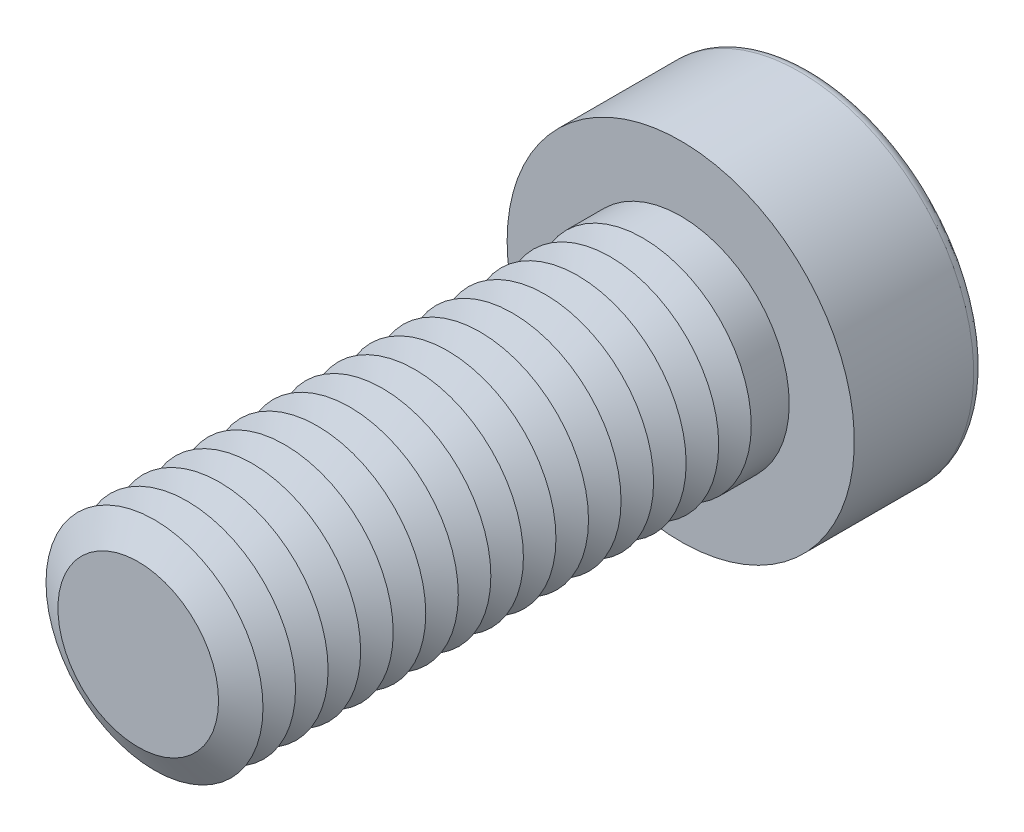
from build123d import *

# Parameters (mm, degrees)
SKETCH1_R           = 5
BOSS_EXTRUDE1_DEPTH = 25
SKETCH2_R           = 8
BOSS_EXTRUDE2_DEPTH = 6
CUT_EXTRUDE1_DEPTH  = 5.25
FILLET1_R           = 0.5
LPATTERN1_COUNT     = 16
LPATTERN1_PITCH     = 1.5


with BuildPart() as part:
    # Sketch1 → Boss-Extrude1 (new body)
    with BuildSketch(Plane.XY):
        Circle(SKETCH1_R)
    extrude(amount=BOSS_EXTRUDE1_DEPTH)

    # Sketch2 → Boss-Extrude2 (add)
    with BuildSketch(Plane(origin=(0, 0, 0), x_dir=(-1, 0, 0), z_dir=(0, 0, -1))):
        Circle(SKETCH2_R)
    extrude(amount=BOSS_EXTRUDE2_DEPTH)

    # Sketch3 → Cut-Extrude1 (cut)
    with BuildSketch(Plane(origin=(0, 0, -6), x_dir=(-1, 0, 0), z_dir=(0, 0, -1))):
        Polygon((-2.020725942, 3.5), (-4.041451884, 0), (-2.020725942, -3.5), (2.020725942, -3.5), (4.041451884, 0), (2.020725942, 3.5), align=None)
    extrude(amount=-CUT_EXTRUDE1_DEPTH, mode=Mode.SUBTRACT)

    # Fillet1
    fillet1_edges = [part.edges().sort_by_distance(p)[0] for p in [
        (8, 0, -6),
    ]]
    fillet(fillet1_edges, radius=FILLET1_R)

    # Cut-Extrude2 cone 1 section (on through the dimple's axis) → Cut-Extrude2 (revolve, cut)
    with BuildSketch(Plane(origin=(0, 0, -0.75), x_dir=(0, 1, 0), z_dir=(1, 0, 0))):
        Polygon((0, 0), (3.5, 0), (0, 2.020725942), align=None)
    revolve(axis=Axis((0, 0, -0.75), (0, 0, 1)), mode=Mode.SUBTRACT)

    # Cut-Extrude3 cone 1 section (on through the dimple's axis) → Cut-Extrude3 (revolve, cut)
    with BuildSketch(Plane(origin=(0, 0, -6), x_dir=(0, 1, 0), z_dir=(1, 0, 0))):
        Polygon((0, 0), (4.041451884, 0), (0, 1.082903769), align=None)
    revolve(axis=Axis((0, 0, -6), (0, 0, 1)), mode=Mode.SUBTRACT)

    # Sketch7 → Cut-Revolve1 (revolve, cut)
    with BuildSketch(Plane(origin=(0, 0, 0), x_dir=(0, 0, -1), z_dir=(1, 0, 0)), mode=Mode.PRIVATE) as cut_revolve1_sk:
        Polygon((-25, 3.700961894), (-24.25, 5), (-25.75, 5), align=None)
    cut_revolve1 = revolve(cut_revolve1_sk.sketch.rotate(Axis((0, 0, 25), (0, 0, -1)), 90), axis=Axis((0, 0, 25), (0, 0, -1)), mode=Mode.SUBTRACT)

    # LPattern1: Cut-Revolve1 ×16
    with Locations(*[(0, 0, -i * LPATTERN1_PITCH) for i in range(1, LPATTERN1_COUNT)]):
        add(cut_revolve1, mode=Mode.SUBTRACT)


solid = part.part
